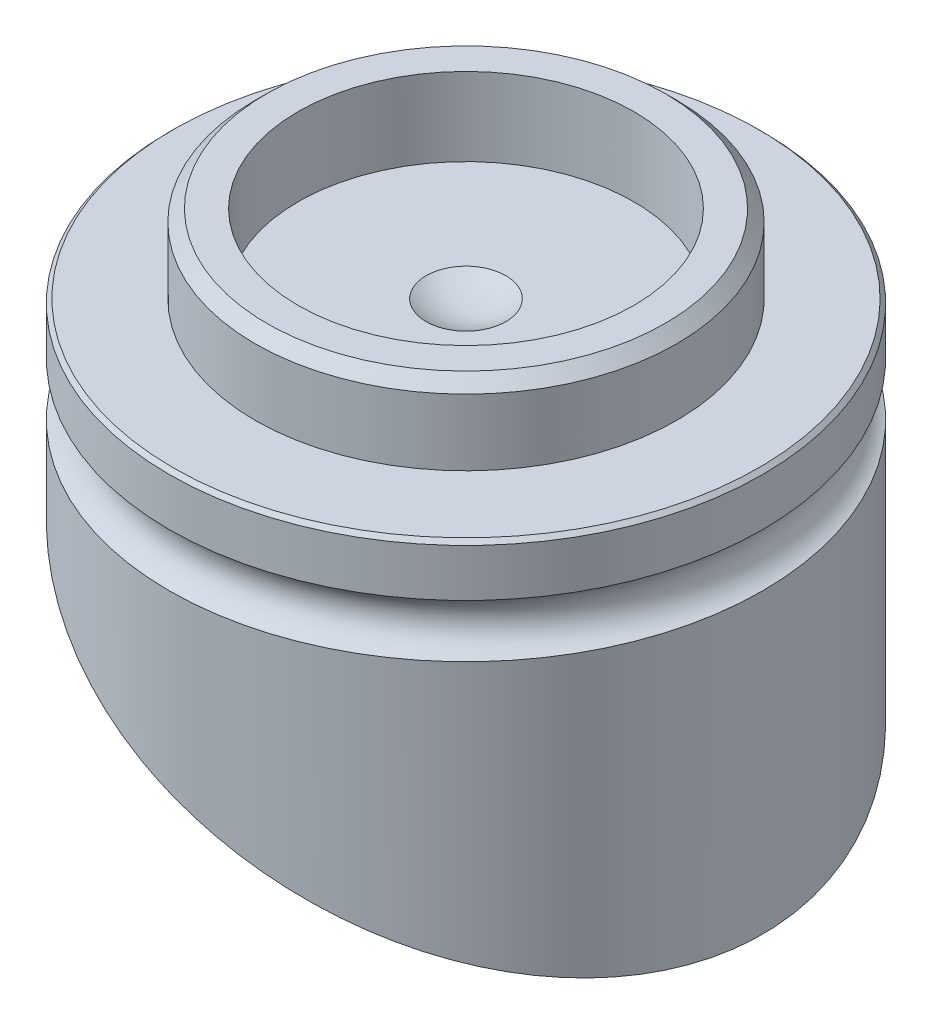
from build123d import *

# Parameters (mm, degrees)
ESQUISSE1_W               = 40
ESQUISSE1_H               = 40
BOSS_EXTRU_1_DEPTH        = 50
ESQUISSE2_R               = 28.284271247
ESQUISSE2_R_2             = 19
ENL_V_MAT_EXTRU_1_DEPTH   = 58.445626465
ESQUISSE3_R               = 10.75
ENL_V_MAT_EXTRU_3_DEPTH   = 15
ESQUISSE4_R               = 19
ESQUISSE4_R_2             = 13.5
ENL_V_MAT_EXTRU_4_DEPTH   = 15
CHANFREIN3_SIZE           = 0.25
ESQUISSE8_R               = 1.8
ENL_V_MAT_EXTRU_5_DEPTH   = 22.5
TROU_TARAUD_M6X1_01_D     = 5
TROU_TARAUD_M6X1_01_DEPTH = 17
TROU_TARAUD_M6X1_01_TIP   = 1.502151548
ESQUISSE12_W              = 27
ESQUISSE12_H              = 10
ENL_V_MAT_EXTRU_6_DEPTH   = 15
CHANFREIN4_SIZE           = 0.75


with BuildPart() as part:
    # Esquisse1 → Boss.-Extru.1 (new body)
    with BuildSketch(Plane(origin=(0, 0, 0), x_dir=(1, 0, 0), z_dir=(0, 1, 0))):
        Rectangle(ESQUISSE1_W, ESQUISSE1_H)
    extrude(amount=BOSS_EXTRU_1_DEPTH)

    # Esquisse2 → Enl_v. mat.-Extru.1 (cut, through all)
    with BuildSketch(Plane(origin=(0, 50, 0), x_dir=(-1, 0, 0), z_dir=(0, 1, 0))):
        Circle(ESQUISSE2_R)
        with Locations(Location((0, 0, 0), (0, 0, 90))):
            Circle(ESQUISSE2_R_2, mode=Mode.SUBTRACT)
    extrude(amount=-ENL_V_MAT_EXTRU_1_DEPTH, mode=Mode.SUBTRACT)

    # Esquisse3 → Enl_v. mat.-Extru.3 (cut)
    with BuildSketch(Plane(origin=(0, 50, 0), x_dir=(-1, 0, 0), z_dir=(0, 1, 0))):
        with Locations(Location((0, 0, 0), (0, 0, 90))):
            Circle(ESQUISSE3_R)
    extrude(amount=-ENL_V_MAT_EXTRU_3_DEPTH, mode=Mode.SUBTRACT)

    # Esquisse4 → Enl_v. mat.-Extru.4 (cut)
    with BuildSketch(Plane(origin=(0, 50, 0), x_dir=(-1, 0, 0), z_dir=(0, 1, 0))):
        with Locations(Location((0, 0, 0), (0, 0, 90))):
            Circle(ESQUISSE4_R)
        with Locations(Location((0, 0, 0), (0, 0, 90))):
            Circle(ESQUISSE4_R_2, mode=Mode.SUBTRACT)
    extrude(amount=-ENL_V_MAT_EXTRU_4_DEPTH, mode=Mode.SUBTRACT)

    # Esquisse5 → Enl_vement de mati_re-R_volution1 (revolve, cut)
    with BuildSketch(Plane.XY):
        with BuildLine():
            Line((0, 34.3), (0, 44.3))
            ThreePointArc((0, 44.3), (-5, 39.3), (0, 34.3))
        make_face()
    revolve(axis=Axis((0, 0, 0), (0, 1, 0)), mode=Mode.SUBTRACT)

    # Chanfrein3
    chanfrein3_edges = [part.edges().sort_by_distance(p)[0] for p in [
        (0, 50, -10.75),
        (0, 35, -19),
    ]]
    chamfer(chanfrein3_edges, length=CHANFREIN3_SIZE)

    # Esquisse8 → Enl_vement de mati_re-R_volution2 (revolve, cut)
    with BuildSketch(Plane.XY, mode=Mode.PRIVATE) as enl_vement_de_mati_re_r_volution2_sk:
        with Locations((-19.6, 30)):
            Circle(ESQUISSE8_R)
    revolve(enl_vement_de_mati_re_r_volution2_sk.sketch.rotate(Axis((0, 0, 0), (0, 1, 0)), 90), axis=Axis((0, 0, 0), (0, 1, 0)), mode=Mode.SUBTRACT)

    # Esquisse6 → Enl_v. mat.-Extru.5 (cut, symmetric)
    with BuildSketch(Plane.XY):
        Polygon((-19, 25), (19, 9.25988463), (19, 0), (-19, 0), align=None)
    extrude(amount=ENL_V_MAT_EXTRU_5_DEPTH, both=True, mode=Mode.SUBTRACT)

    # Trou taraud_ M6x1.01
    with Locations(Plane(origin=(6.056349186, 14.621320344, 0), x_dir=(0.9238795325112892, -0.38268343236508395, 0), z_dir=(-0.38268343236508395, -0.9238795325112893, 0))):
        with Locations((-6.555345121, 0)):
            Hole(TROU_TARAUD_M6X1_01_D / 2, depth=TROU_TARAUD_M6X1_01_DEPTH)
            with Locations((0, 0, -(TROU_TARAUD_M6X1_01_DEPTH + TROU_TARAUD_M6X1_01_TIP / 2))):  # 118° drill point
                Cone(0, TROU_TARAUD_M6X1_01_D / 2, TROU_TARAUD_M6X1_01_TIP, mode=Mode.SUBTRACT)

    # Esquisse12 → Enl_v. mat.-Extru.6 (cut, symmetric)
    with BuildSketch(Plane.XY):
        with Locations((0, 45)):
            Rectangle(ESQUISSE12_W, ESQUISSE12_H)
    extrude(amount=ENL_V_MAT_EXTRU_6_DEPTH, both=True, mode=Mode.SUBTRACT)

    # Chanfrein4
    chanfrein4_edges = [part.edges().sort_by_distance(p)[0] for p in [
        (0, 40, -13.5),
    ]]
    chamfer(chanfrein4_edges, length=CHANFREIN4_SIZE)


solid = part.part
